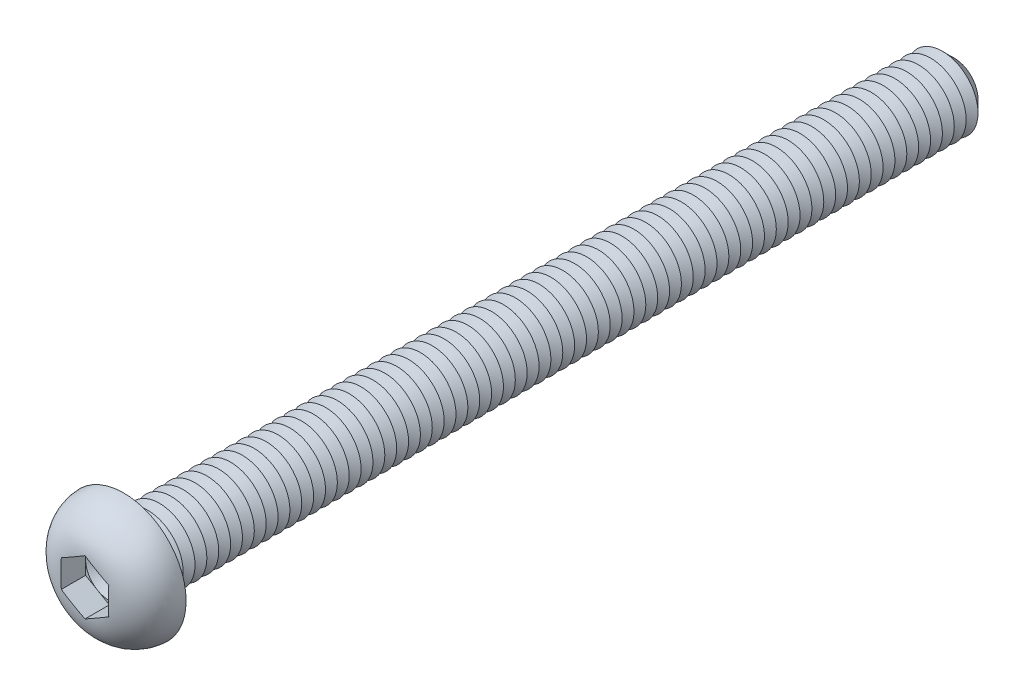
from build123d import *

# Parameters (mm, degrees)
CUT_EXTRUDE1_DEPTH  = 2.08
SKETCH4_R           = 3
BOSS_EXTRUDE1_DEPTH = 70
CHAMFER1_SIZE       = 1
LPATTERN1_COUNT     = 68
LPATTERN1_PITCH     = 1
FILLET2_R           = 0.4


with BuildPart() as part:
    # Sketch2 → Revolve1 (revolve)
    with BuildSketch(Plane(origin=(0, 0, 0), x_dir=(0, 0, -1), z_dir=(1, 0, 0)), mode=Mode.PRIVATE) as revolve1_sk:
        with BuildLine():
            Line((0, 0), (-3.3, 0))
            Line((-3.3, 0), (-3.3, 1.851470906))
            ThreePointArc((-3.3, 1.851470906), (-2.339262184, 4.220014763), (0, 5.25))
            Line((0, 5.25), (0, 0))
        make_face()
    revolve(revolve1_sk.sketch.rotate(Axis((0, 0, 47.934239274), (0, 0, -1)), 90), axis=Axis((0, 0, 47.934239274), (0, 0, -1)))

    # Sketch3 → Cut-Extrude1 (cut)
    with BuildSketch(Plane.XY.offset(3.3)):
        Polygon((0, 2.309401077), (-2, 1.154700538), (-2, -1.154700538), (0, -2.309401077), (2, -1.154700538), (2, 1.154700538), align=None)
    extrude(amount=-CUT_EXTRUDE1_DEPTH, mode=Mode.SUBTRACT)

    # Sketch4 → Boss-Extrude1 (add)
    with BuildSketch(Plane(origin=(0, 0, 0), x_dir=(-1, 0, 0), z_dir=(0, 0, -1))):
        Circle(SKETCH4_R)
    extrude(amount=BOSS_EXTRUDE1_DEPTH)

    # Chamfer1
    chamfer1_edges = [part.edges().sort_by_distance(p)[0] for p in [
        (3, 0, -70),
    ]]
    chamfer(chamfer1_edges, length=CHAMFER1_SIZE)

    # Sketch5 → Cut-Revolve1 (revolve, cut)
    with BuildSketch(Plane(origin=(0, 0, 0), x_dir=(0, 0, -1), z_dir=(1, 0, 0)), mode=Mode.PRIVATE) as cut_revolve1_sk:
        Polygon((1, 3), (2, 3), (1.5, 2.133974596), align=None)
    cut_revolve1 = revolve(cut_revolve1_sk.sketch.rotate(Axis((0, 0, 47.934239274), (0, 0, -1)), 90), axis=Axis((0, 0, 47.934239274), (0, 0, -1)), mode=Mode.SUBTRACT)

    # LPattern1: Cut-Revolve1 ×68
    with Locations(*[(0, 0, -i * LPATTERN1_PITCH) for i in range(1, LPATTERN1_COUNT)]):
        add(cut_revolve1, mode=Mode.SUBTRACT)

    # Fillet2
    fillet2_edges = [part.edges().sort_by_distance(p)[0] for p in [
        (3, 0, 0),
    ]]
    fillet(fillet2_edges, radius=FILLET2_R)

    # Cut-Extrude2 cone 1 section (on through the dimple's axis) → Cut-Extrude2 (revolve, cut)
    with BuildSketch(Plane(origin=(0, 0, 1.22), x_dir=(0, -1, 0), z_dir=(1, 0, 0))):
        Polygon((0, 0), (2, 0), (0, 1.154700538), align=None)
    revolve(axis=Axis((0, 0, 1.22), (0, 0, -1)), mode=Mode.SUBTRACT)


solid = part.part
